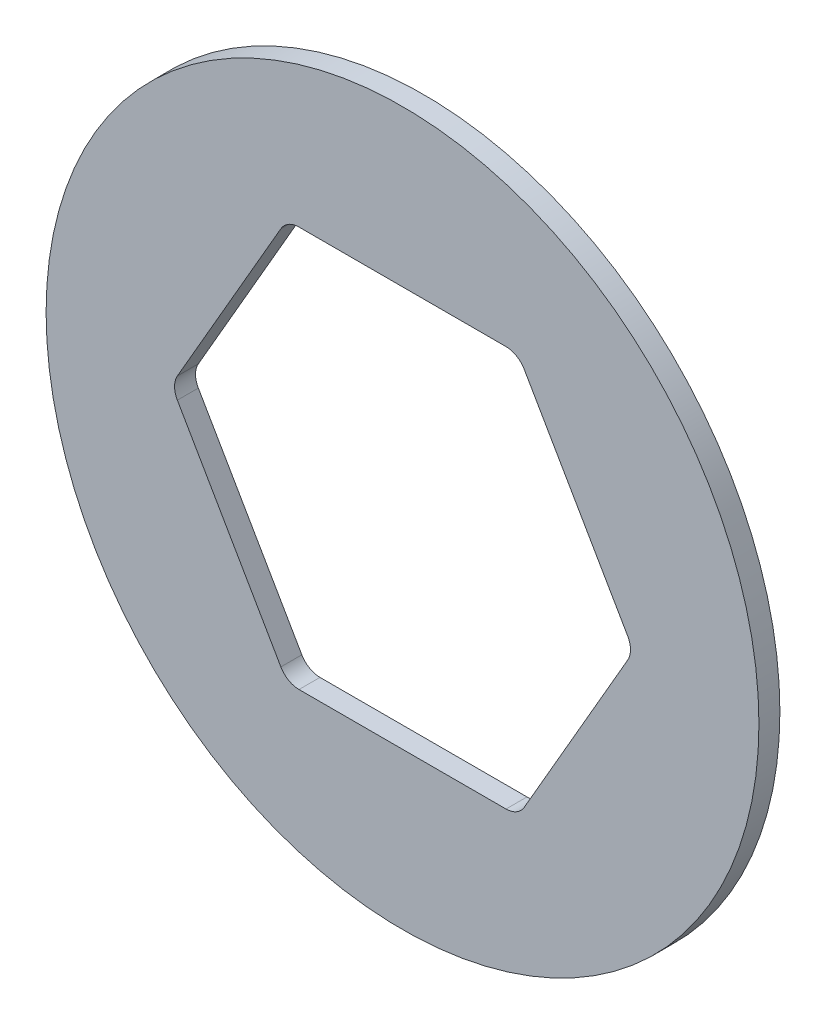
ISO-10303-21;
HEADER;
FILE_DESCRIPTION(('STEP AP214'),'2;1');
FILE_NAME('part.step','',(''),(''),'','','');
FILE_SCHEMA(('AUTOMOTIVE_DESIGN { 1 0 10303 214 1 1 1 1 }'));
ENDSEC;
DATA;
#1=APPLICATION_CONTEXT('core data for automotive mechanical design processes');
#2=APPLICATION_PROTOCOL_DEFINITION('international standard','automotive_design',2000,#1);
#3=PRODUCT_CONTEXT('',#1,'mechanical');
#4=PRODUCT('Part','Part','',(#3));
#5=PRODUCT_RELATED_PRODUCT_CATEGORY('part','',(#4));
#6=PRODUCT_DEFINITION_FORMATION('','',#4);
#7=PRODUCT_DEFINITION_CONTEXT('part definition',#1,'design');
#8=PRODUCT_DEFINITION('design','',#6,#7);
#9=PRODUCT_DEFINITION_SHAPE('','',#8);
#10=(LENGTH_UNIT() NAMED_UNIT(*) SI_UNIT(.MILLI.,.METRE.));
#11=(NAMED_UNIT(*) PLANE_ANGLE_UNIT() SI_UNIT($,.RADIAN.));
#12=(NAMED_UNIT(*) SI_UNIT($,.STERADIAN.) SOLID_ANGLE_UNIT());
#13=UNCERTAINTY_MEASURE_WITH_UNIT(LENGTH_MEASURE(1.E-05),#10,'distance_accuracy_value','');
#14=(GEOMETRIC_REPRESENTATION_CONTEXT(3) GLOBAL_UNCERTAINTY_ASSIGNED_CONTEXT((#13)) GLOBAL_UNIT_ASSIGNED_CONTEXT((#10,
#11,#12)) REPRESENTATION_CONTEXT('',''));
#15=CARTESIAN_POINT('',(0.,0.,0.));
#16=DIRECTION('',(0.,0.,1.));
#17=DIRECTION('',(1.,0.,0.));
#18=AXIS2_PLACEMENT_3D('',#15,#16,#17);
#19=CARTESIAN_POINT('',(0.,0.,1.));
#20=DIRECTION('',(0.,0.,1.));
#21=DIRECTION('',(1.,0.,0.));
#22=AXIS2_PLACEMENT_3D('',#19,#20,#21);
#23=PLANE('',#22);
#24=CARTESIAN_POINT('',(0.,0.,1.));
#25=DIRECTION('',(0.,0.,1.));
#26=DIRECTION('',(1.,0.,0.));
#27=AXIS2_PLACEMENT_3D('',#24,#25,#26);
#28=CIRCLE('',#27,17.);
#29=CARTESIAN_POINT('',(17.,0.,1.));
#30=VERTEX_POINT('',#29);
#31=EDGE_CURVE('E149',#30,#30,#28,.T.);
#32=ORIENTED_EDGE('',*,*,#31,.T.);
#33=EDGE_LOOP('',(#32));
#34=FACE_BOUND('',#33,.T.);
#35=DIRECTION('',(0.5,0.866025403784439,0.));
#36=VECTOR('',#35,1.);
#37=CARTESIAN_POINT('',(5.51369507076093,-9.55,1.));
#38=LINE('',#37,#36);
#39=CARTESIAN_POINT('',(5.80237020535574,-9.05,1.));
#40=VERTEX_POINT('',#39);
#41=CARTESIAN_POINT('',(10.738715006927,-0.499999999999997,1.));
#42=VERTEX_POINT('',#41);
#43=EDGE_CURVE('E213',#40,#42,#38,.T.);
#44=ORIENTED_EDGE('',*,*,#43,.F.);
#45=CARTESIAN_POINT('',(4.9363448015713,-8.55,1.));
#46=DIRECTION('',(0.,0.,1.));
#47=DIRECTION('',(1.,0.,0.));
#48=AXIS2_PLACEMENT_3D('',#45,#46,#47);
#49=CIRCLE('',#48,1.);
#50=CARTESIAN_POINT('',(4.9363448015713,-9.55,1.));
#51=VERTEX_POINT('',#50);
#52=EDGE_CURVE('E134',#40,#51,#49,.F.);
#53=ORIENTED_EDGE('',*,*,#52,.T.);
#54=DIRECTION('',(1.,0.,0.));
#55=VECTOR('',#54,1.);
#56=CARTESIAN_POINT('',(-5.51369507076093,-9.55,1.));
#57=LINE('',#56,#55);
#58=CARTESIAN_POINT('',(-4.9363448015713,-9.55,1.));
#59=VERTEX_POINT('',#58);
#60=EDGE_CURVE('E217',#59,#51,#57,.T.);
#61=ORIENTED_EDGE('',*,*,#60,.F.);
#62=CARTESIAN_POINT('',(-4.9363448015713,-8.55,1.));
#63=DIRECTION('',(0.,0.,1.));
#64=DIRECTION('',(1.,0.,0.));
#65=AXIS2_PLACEMENT_3D('',#62,#63,#64);
#66=CIRCLE('',#65,1.);
#67=CARTESIAN_POINT('',(-5.80237020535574,-9.05,1.));
#68=VERTEX_POINT('',#67);
#69=EDGE_CURVE('E186',#59,#68,#66,.F.);
#70=ORIENTED_EDGE('',*,*,#69,.T.);
#71=DIRECTION('',(0.5,-0.866025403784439,0.));
#72=VECTOR('',#71,1.);
#73=CARTESIAN_POINT('',(-11.0273901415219,0.,1.));
#74=LINE('',#73,#72);
#75=CARTESIAN_POINT('',(-10.738715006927,-0.499999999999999,1.));
#76=VERTEX_POINT('',#75);
#77=EDGE_CURVE('E223',#76,#68,#74,.T.);
#78=ORIENTED_EDGE('',*,*,#77,.F.);
#79=CARTESIAN_POINT('',(-9.8726896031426,0.,1.));
#80=DIRECTION('',(0.,0.,1.));
#81=DIRECTION('',(1.,0.,0.));
#82=AXIS2_PLACEMENT_3D('',#79,#80,#81);
#83=CIRCLE('',#82,1.);
#84=CARTESIAN_POINT('',(-10.738715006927,0.500000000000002,1.));
#85=VERTEX_POINT('',#84);
#86=EDGE_CURVE('E190',#76,#85,#83,.F.);
#87=ORIENTED_EDGE('',*,*,#86,.T.);
#88=DIRECTION('',(-0.5,-0.866025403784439,0.));
#89=VECTOR('',#88,1.);
#90=CARTESIAN_POINT('',(-5.51369507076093,9.55,1.));
#91=LINE('',#90,#89);
#92=CARTESIAN_POINT('',(-5.80237020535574,9.05,1.));
#93=VERTEX_POINT('',#92);
#94=EDGE_CURVE('E215',#93,#85,#91,.T.);
#95=ORIENTED_EDGE('',*,*,#94,.F.);
#96=CARTESIAN_POINT('',(-4.9363448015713,8.55,1.));
#97=DIRECTION('',(0.,0.,1.));
#98=DIRECTION('',(1.,0.,0.));
#99=AXIS2_PLACEMENT_3D('',#96,#97,#98);
#100=CIRCLE('',#99,1.);
#101=CARTESIAN_POINT('',(-4.9363448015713,9.55,1.));
#102=VERTEX_POINT('',#101);
#103=EDGE_CURVE('E48',#93,#102,#100,.F.);
#104=ORIENTED_EDGE('',*,*,#103,.T.);
#105=DIRECTION('',(-1.,0.,0.));
#106=VECTOR('',#105,1.);
#107=CARTESIAN_POINT('',(5.51369507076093,9.55,1.));
#108=LINE('',#107,#106);
#109=CARTESIAN_POINT('',(4.9363448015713,9.55,1.));
#110=VERTEX_POINT('',#109);
#111=EDGE_CURVE('E209',#110,#102,#108,.T.);
#112=ORIENTED_EDGE('',*,*,#111,.F.);
#113=CARTESIAN_POINT('',(4.9363448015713,8.55,1.));
#114=DIRECTION('',(0.,0.,1.));
#115=DIRECTION('',(1.,0.,0.));
#116=AXIS2_PLACEMENT_3D('',#113,#114,#115);
#117=CIRCLE('',#116,1.);
#118=CARTESIAN_POINT('',(5.80237020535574,9.05,1.));
#119=VERTEX_POINT('',#118);
#120=EDGE_CURVE('E11',#110,#119,#117,.F.);
#121=ORIENTED_EDGE('',*,*,#120,.T.);
#122=DIRECTION('',(-0.5,0.866025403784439,0.));
#123=VECTOR('',#122,1.);
#124=CARTESIAN_POINT('',(11.0273901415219,0.,1.));
#125=LINE('',#124,#123);
#126=CARTESIAN_POINT('',(10.738715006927,0.5,1.));
#127=VERTEX_POINT('',#126);
#128=EDGE_CURVE('E207',#127,#119,#125,.T.);
#129=ORIENTED_EDGE('',*,*,#128,.F.);
#130=CARTESIAN_POINT('',(9.8726896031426,0.,1.));
#131=DIRECTION('',(0.,0.,1.));
#132=DIRECTION('',(1.,0.,0.));
#133=AXIS2_PLACEMENT_3D('',#130,#131,#132);
#134=CIRCLE('',#133,1.);
#135=EDGE_CURVE('E135',#127,#42,#134,.F.);
#136=ORIENTED_EDGE('',*,*,#135,.T.);
#137=EDGE_LOOP('',(#44,#53,#61,#70,#78,#87,#95,#104,#112,#121,#129,#136));
#138=FACE_BOUND('',#137,.T.);
#139=ADVANCED_FACE('F33',(#34,#138),#23,.T.);
#140=CARTESIAN_POINT('',(0.,0.,0.));
#141=DIRECTION('',(0.,0.,1.));
#142=DIRECTION('',(1.,0.,0.));
#143=AXIS2_PLACEMENT_3D('',#140,#141,#142);
#144=PLANE('',#143);
#145=CARTESIAN_POINT('',(0.,0.,0.));
#146=DIRECTION('',(0.,0.,1.));
#147=DIRECTION('',(1.,0.,0.));
#148=AXIS2_PLACEMENT_3D('',#145,#146,#147);
#149=CIRCLE('',#148,17.);
#150=CARTESIAN_POINT('',(17.,0.,0.));
#151=VERTEX_POINT('',#150);
#152=EDGE_CURVE('E154',#151,#151,#149,.T.);
#153=ORIENTED_EDGE('',*,*,#152,.F.);
#154=EDGE_LOOP('',(#153));
#155=FACE_BOUND('',#154,.T.);
#156=DIRECTION('',(0.5,-0.866025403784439,0.));
#157=VECTOR('',#156,1.);
#158=CARTESIAN_POINT('',(-11.0273901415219,0.,0.));
#159=LINE('',#158,#157);
#160=CARTESIAN_POINT('',(-10.738715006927,-0.499999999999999,0.));
#161=VERTEX_POINT('',#160);
#162=CARTESIAN_POINT('',(-5.80237020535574,-9.05,0.));
#163=VERTEX_POINT('',#162);
#164=EDGE_CURVE('E230',#161,#163,#159,.T.);
#165=ORIENTED_EDGE('',*,*,#164,.T.);
#166=CARTESIAN_POINT('',(-4.9363448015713,-8.55,0.));
#167=DIRECTION('',(0.,0.,1.));
#168=DIRECTION('',(1.,0.,0.));
#169=AXIS2_PLACEMENT_3D('',#166,#167,#168);
#170=CIRCLE('',#169,1.);
#171=CARTESIAN_POINT('',(-4.9363448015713,-9.55,0.));
#172=VERTEX_POINT('',#171);
#173=EDGE_CURVE('E184',#163,#172,#170,.T.);
#174=ORIENTED_EDGE('',*,*,#173,.T.);
#175=DIRECTION('',(1.,0.,0.));
#176=VECTOR('',#175,1.);
#177=CARTESIAN_POINT('',(-5.51369507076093,-9.55,0.));
#178=LINE('',#177,#176);
#179=CARTESIAN_POINT('',(4.9363448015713,-9.55,0.));
#180=VERTEX_POINT('',#179);
#181=EDGE_CURVE('E129',#172,#180,#178,.T.);
#182=ORIENTED_EDGE('',*,*,#181,.T.);
#183=CARTESIAN_POINT('',(4.9363448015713,-8.55,0.));
#184=DIRECTION('',(0.,0.,1.));
#185=DIRECTION('',(1.,0.,0.));
#186=AXIS2_PLACEMENT_3D('',#183,#184,#185);
#187=CIRCLE('',#186,1.);
#188=CARTESIAN_POINT('',(5.80237020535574,-9.05,0.));
#189=VERTEX_POINT('',#188);
#190=EDGE_CURVE('E123',#180,#189,#187,.T.);
#191=ORIENTED_EDGE('',*,*,#190,.T.);
#192=DIRECTION('',(0.5,0.866025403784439,0.));
#193=VECTOR('',#192,1.);
#194=CARTESIAN_POINT('',(5.51369507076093,-9.55,0.));
#195=LINE('',#194,#193);
#196=CARTESIAN_POINT('',(10.738715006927,-0.499999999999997,0.));
#197=VERTEX_POINT('',#196);
#198=EDGE_CURVE('E127',#189,#197,#195,.T.);
#199=ORIENTED_EDGE('',*,*,#198,.T.);
#200=CARTESIAN_POINT('',(9.8726896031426,0.,0.));
#201=DIRECTION('',(0.,0.,1.));
#202=DIRECTION('',(1.,0.,0.));
#203=AXIS2_PLACEMENT_3D('',#200,#201,#202);
#204=CIRCLE('',#203,1.);
#205=CARTESIAN_POINT('',(10.738715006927,0.5,0.));
#206=VERTEX_POINT('',#205);
#207=EDGE_CURVE('E180',#197,#206,#204,.T.);
#208=ORIENTED_EDGE('',*,*,#207,.T.);
#209=DIRECTION('',(-0.5,0.866025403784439,0.));
#210=VECTOR('',#209,1.);
#211=CARTESIAN_POINT('',(11.0273901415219,0.,0.));
#212=LINE('',#211,#210);
#213=CARTESIAN_POINT('',(5.80237020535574,9.05,0.));
#214=VERTEX_POINT('',#213);
#215=EDGE_CURVE('E145',#206,#214,#212,.T.);
#216=ORIENTED_EDGE('',*,*,#215,.T.);
#217=CARTESIAN_POINT('',(4.9363448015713,8.55,0.));
#218=DIRECTION('',(0.,0.,1.));
#219=DIRECTION('',(1.,0.,0.));
#220=AXIS2_PLACEMENT_3D('',#217,#218,#219);
#221=CIRCLE('',#220,1.);
#222=CARTESIAN_POINT('',(4.9363448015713,9.55,0.));
#223=VERTEX_POINT('',#222);
#224=EDGE_CURVE('E41',#214,#223,#221,.T.);
#225=ORIENTED_EDGE('',*,*,#224,.T.);
#226=DIRECTION('',(-1.,0.,0.));
#227=VECTOR('',#226,1.);
#228=CARTESIAN_POINT('',(5.51369507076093,9.55,0.));
#229=LINE('',#228,#227);
#230=CARTESIAN_POINT('',(-4.9363448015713,9.55,0.));
#231=VERTEX_POINT('',#230);
#232=EDGE_CURVE('E196',#223,#231,#229,.T.);
#233=ORIENTED_EDGE('',*,*,#232,.T.);
#234=CARTESIAN_POINT('',(-4.9363448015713,8.55,0.));
#235=DIRECTION('',(0.,0.,1.));
#236=DIRECTION('',(1.,0.,0.));
#237=AXIS2_PLACEMENT_3D('',#234,#235,#236);
#238=CIRCLE('',#237,1.);
#239=CARTESIAN_POINT('',(-5.80237020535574,9.05,0.));
#240=VERTEX_POINT('',#239);
#241=EDGE_CURVE('E192',#231,#240,#238,.T.);
#242=ORIENTED_EDGE('',*,*,#241,.T.);
#243=DIRECTION('',(-0.5,-0.866025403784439,0.));
#244=VECTOR('',#243,1.);
#245=CARTESIAN_POINT('',(-5.51369507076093,9.55,0.));
#246=LINE('',#245,#244);
#247=CARTESIAN_POINT('',(-10.738715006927,0.500000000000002,0.));
#248=VERTEX_POINT('',#247);
#249=EDGE_CURVE('E202',#240,#248,#246,.T.);
#250=ORIENTED_EDGE('',*,*,#249,.T.);
#251=CARTESIAN_POINT('',(-9.8726896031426,0.,0.));
#252=DIRECTION('',(0.,0.,1.));
#253=DIRECTION('',(1.,0.,0.));
#254=AXIS2_PLACEMENT_3D('',#251,#252,#253);
#255=CIRCLE('',#254,1.);
#256=EDGE_CURVE('E188',#248,#161,#255,.T.);
#257=ORIENTED_EDGE('',*,*,#256,.T.);
#258=EDGE_LOOP('',(#165,#174,#182,#191,#199,#208,#216,#225,#233,#242,#250,#257));
#259=FACE_BOUND('',#258,.T.);
#260=ADVANCED_FACE('F126',(#155,#259),#144,.F.);
#261=CARTESIAN_POINT('',(0.,0.,1.));
#262=DIRECTION('',(0.,0.,-1.));
#263=DIRECTION('',(-1.,0.,0.));
#264=AXIS2_PLACEMENT_3D('',#261,#262,#263);
#265=CYLINDRICAL_SURFACE('',#264,17.);
#266=ORIENTED_EDGE('',*,*,#31,.F.);
#267=EDGE_LOOP('',(#266));
#268=FACE_BOUND('',#267,.T.);
#269=ORIENTED_EDGE('',*,*,#152,.T.);
#270=EDGE_LOOP('',(#269));
#271=FACE_BOUND('',#270,.T.);
#272=ADVANCED_FACE('F267',(#268,#271),#265,.T.);
#273=CARTESIAN_POINT('',(-5.51369507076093,-9.55,1.));
#274=DIRECTION('',(0.,1.,0.));
#275=DIRECTION('',(-1.,0.,0.));
#276=AXIS2_PLACEMENT_3D('',#273,#274,#275);
#277=PLANE('',#276);
#278=ORIENTED_EDGE('',*,*,#60,.T.);
#279=DIRECTION('',(0.,0.,-1.));
#280=VECTOR('',#279,1.);
#281=CARTESIAN_POINT('',(4.9363448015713,-9.55,0.));
#282=LINE('',#281,#280);
#283=EDGE_CURVE('E164',#51,#180,#282,.T.);
#284=ORIENTED_EDGE('',*,*,#283,.T.);
#285=ORIENTED_EDGE('',*,*,#181,.F.);
#286=DIRECTION('',(0.,0.,-1.));
#287=VECTOR('',#286,1.);
#288=CARTESIAN_POINT('',(-4.9363448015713,-9.55,1.));
#289=LINE('',#288,#287);
#290=EDGE_CURVE('E162',#172,#59,#289,.F.);
#291=ORIENTED_EDGE('',*,*,#290,.T.);
#292=EDGE_LOOP('',(#278,#284,#285,#291));
#293=FACE_BOUND('',#292,.T.);
#294=ADVANCED_FACE('F235',(#293),#277,.T.);
#295=CARTESIAN_POINT('',(5.51369507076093,-9.55,1.));
#296=DIRECTION('',(-0.866025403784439,0.5,0.));
#297=DIRECTION('',(-0.5,-0.866025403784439,0.));
#298=AXIS2_PLACEMENT_3D('',#295,#296,#297);
#299=PLANE('',#298);
#300=ORIENTED_EDGE('',*,*,#43,.T.);
#301=DIRECTION('',(0.,0.,-1.));
#302=VECTOR('',#301,1.);
#303=CARTESIAN_POINT('',(10.738715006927,-0.5,0.));
#304=LINE('',#303,#302);
#305=EDGE_CURVE('E144',#42,#197,#304,.T.);
#306=ORIENTED_EDGE('',*,*,#305,.T.);
#307=ORIENTED_EDGE('',*,*,#198,.F.);
#308=DIRECTION('',(0.,0.,-1.));
#309=VECTOR('',#308,1.);
#310=CARTESIAN_POINT('',(5.80237020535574,-9.05,1.));
#311=LINE('',#310,#309);
#312=EDGE_CURVE('E141',#189,#40,#311,.F.);
#313=ORIENTED_EDGE('',*,*,#312,.T.);
#314=EDGE_LOOP('',(#300,#306,#307,#313));
#315=FACE_BOUND('',#314,.T.);
#316=ADVANCED_FACE('F140',(#315),#299,.T.);
#317=CARTESIAN_POINT('',(11.0273901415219,0.,1.));
#318=DIRECTION('',(-0.866025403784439,-0.5,0.));
#319=DIRECTION('',(0.5,-0.866025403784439,0.));
#320=AXIS2_PLACEMENT_3D('',#317,#318,#319);
#321=PLANE('',#320);
#322=ORIENTED_EDGE('',*,*,#215,.F.);
#323=DIRECTION('',(0.,0.,-1.));
#324=VECTOR('',#323,1.);
#325=CARTESIAN_POINT('',(10.738715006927,0.5,1.));
#326=LINE('',#325,#324);
#327=EDGE_CURVE('E160',#206,#127,#326,.F.);
#328=ORIENTED_EDGE('',*,*,#327,.T.);
#329=ORIENTED_EDGE('',*,*,#128,.T.);
#330=DIRECTION('',(0.,0.,-1.));
#331=VECTOR('',#330,1.);
#332=CARTESIAN_POINT('',(5.80237020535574,9.05,0.));
#333=LINE('',#332,#331);
#334=EDGE_CURVE('E151',#119,#214,#333,.T.);
#335=ORIENTED_EDGE('',*,*,#334,.T.);
#336=EDGE_LOOP('',(#322,#328,#329,#335));
#337=FACE_BOUND('',#336,.T.);
#338=ADVANCED_FACE('F211',(#337),#321,.T.);
#339=CARTESIAN_POINT('',(5.51369507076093,9.55,1.));
#340=DIRECTION('',(0.,-1.,0.));
#341=DIRECTION('',(0.,0.,-1.));
#342=AXIS2_PLACEMENT_3D('',#339,#340,#341);
#343=PLANE('',#342);
#344=ORIENTED_EDGE('',*,*,#111,.T.);
#345=DIRECTION('',(0.,0.,-1.));
#346=VECTOR('',#345,1.);
#347=CARTESIAN_POINT('',(-4.9363448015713,9.55,0.));
#348=LINE('',#347,#346);
#349=EDGE_CURVE('E177',#102,#231,#348,.T.);
#350=ORIENTED_EDGE('',*,*,#349,.T.);
#351=ORIENTED_EDGE('',*,*,#232,.F.);
#352=DIRECTION('',(0.,0.,-1.));
#353=VECTOR('',#352,1.);
#354=CARTESIAN_POINT('',(4.9363448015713,9.55,1.));
#355=LINE('',#354,#353);
#356=EDGE_CURVE('E55',#223,#110,#355,.F.);
#357=ORIENTED_EDGE('',*,*,#356,.T.);
#358=EDGE_LOOP('',(#344,#350,#351,#357));
#359=FACE_BOUND('',#358,.T.);
#360=ADVANCED_FACE('F200',(#359),#343,.T.);
#361=CARTESIAN_POINT('',(-5.51369507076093,9.55,1.));
#362=DIRECTION('',(0.866025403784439,-0.5,0.));
#363=DIRECTION('',(0.5,0.866025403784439,0.));
#364=AXIS2_PLACEMENT_3D('',#361,#362,#363);
#365=PLANE('',#364);
#366=ORIENTED_EDGE('',*,*,#94,.T.);
#367=DIRECTION('',(0.,0.,-1.));
#368=VECTOR('',#367,1.);
#369=CARTESIAN_POINT('',(-10.738715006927,0.500000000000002,0.));
#370=LINE('',#369,#368);
#371=EDGE_CURVE('E173',#85,#248,#370,.T.);
#372=ORIENTED_EDGE('',*,*,#371,.T.);
#373=ORIENTED_EDGE('',*,*,#249,.F.);
#374=DIRECTION('',(0.,0.,-1.));
#375=VECTOR('',#374,1.);
#376=CARTESIAN_POINT('',(-5.80237020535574,9.05,1.));
#377=LINE('',#376,#375);
#378=EDGE_CURVE('E171',#240,#93,#377,.F.);
#379=ORIENTED_EDGE('',*,*,#378,.T.);
#380=EDGE_LOOP('',(#366,#372,#373,#379));
#381=FACE_BOUND('',#380,.T.);
#382=ADVANCED_FACE('F251',(#381),#365,.T.);
#383=CARTESIAN_POINT('',(-11.0273901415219,0.,1.));
#384=DIRECTION('',(0.866025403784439,0.5,0.));
#385=DIRECTION('',(-0.5,0.866025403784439,0.));
#386=AXIS2_PLACEMENT_3D('',#383,#384,#385);
#387=PLANE('',#386);
#388=ORIENTED_EDGE('',*,*,#77,.T.);
#389=DIRECTION('',(0.,0.,-1.));
#390=VECTOR('',#389,1.);
#391=CARTESIAN_POINT('',(-5.80237020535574,-9.05,0.));
#392=LINE('',#391,#390);
#393=EDGE_CURVE('E168',#68,#163,#392,.T.);
#394=ORIENTED_EDGE('',*,*,#393,.T.);
#395=ORIENTED_EDGE('',*,*,#164,.F.);
#396=DIRECTION('',(0.,0.,-1.));
#397=VECTOR('',#396,1.);
#398=CARTESIAN_POINT('',(-10.738715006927,-0.499999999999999,1.));
#399=LINE('',#398,#397);
#400=EDGE_CURVE('E166',#161,#76,#399,.F.);
#401=ORIENTED_EDGE('',*,*,#400,.T.);
#402=EDGE_LOOP('',(#388,#394,#395,#401));
#403=FACE_BOUND('',#402,.T.);
#404=ADVANCED_FACE('F243',(#403),#387,.T.);
#405=CARTESIAN_POINT('',(9.8726896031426,0.,1.));
#406=DIRECTION('',(0.,0.,1.));
#407=DIRECTION('',(1.,0.,0.));
#408=AXIS2_PLACEMENT_3D('',#405,#406,#407);
#409=CYLINDRICAL_SURFACE('',#408,1.);
#410=ORIENTED_EDGE('',*,*,#135,.F.);
#411=ORIENTED_EDGE('',*,*,#327,.F.);
#412=ORIENTED_EDGE('',*,*,#207,.F.);
#413=ORIENTED_EDGE('',*,*,#305,.F.);
#414=EDGE_LOOP('',(#410,#411,#412,#413));
#415=FACE_BOUND('',#414,.T.);
#416=ADVANCED_FACE('F276',(#415),#409,.F.);
#417=CARTESIAN_POINT('',(4.9363448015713,-8.55,1.));
#418=DIRECTION('',(0.,0.,1.));
#419=DIRECTION('',(1.,0.,0.));
#420=AXIS2_PLACEMENT_3D('',#417,#418,#419);
#421=CYLINDRICAL_SURFACE('',#420,1.);
#422=ORIENTED_EDGE('',*,*,#52,.F.);
#423=ORIENTED_EDGE('',*,*,#312,.F.);
#424=ORIENTED_EDGE('',*,*,#190,.F.);
#425=ORIENTED_EDGE('',*,*,#283,.F.);
#426=EDGE_LOOP('',(#422,#423,#424,#425));
#427=FACE_BOUND('',#426,.T.);
#428=ADVANCED_FACE('F148',(#427),#421,.F.);
#429=CARTESIAN_POINT('',(-4.9363448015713,-8.55,1.));
#430=DIRECTION('',(0.,0.,1.));
#431=DIRECTION('',(1.,0.,0.));
#432=AXIS2_PLACEMENT_3D('',#429,#430,#431);
#433=CYLINDRICAL_SURFACE('',#432,1.);
#434=ORIENTED_EDGE('',*,*,#69,.F.);
#435=ORIENTED_EDGE('',*,*,#290,.F.);
#436=ORIENTED_EDGE('',*,*,#173,.F.);
#437=ORIENTED_EDGE('',*,*,#393,.F.);
#438=EDGE_LOOP('',(#434,#435,#436,#437));
#439=FACE_BOUND('',#438,.T.);
#440=ADVANCED_FACE('F241',(#439),#433,.F.);
#441=CARTESIAN_POINT('',(-9.8726896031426,0.,1.));
#442=DIRECTION('',(0.,0.,1.));
#443=DIRECTION('',(1.,0.,0.));
#444=AXIS2_PLACEMENT_3D('',#441,#442,#443);
#445=CYLINDRICAL_SURFACE('',#444,1.);
#446=ORIENTED_EDGE('',*,*,#86,.F.);
#447=ORIENTED_EDGE('',*,*,#400,.F.);
#448=ORIENTED_EDGE('',*,*,#256,.F.);
#449=ORIENTED_EDGE('',*,*,#371,.F.);
#450=EDGE_LOOP('',(#446,#447,#448,#449));
#451=FACE_BOUND('',#450,.T.);
#452=ADVANCED_FACE('F248',(#451),#445,.F.);
#453=CARTESIAN_POINT('',(-4.9363448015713,8.55,1.));
#454=DIRECTION('',(0.,0.,1.));
#455=DIRECTION('',(1.,0.,0.));
#456=AXIS2_PLACEMENT_3D('',#453,#454,#455);
#457=CYLINDRICAL_SURFACE('',#456,1.);
#458=ORIENTED_EDGE('',*,*,#103,.F.);
#459=ORIENTED_EDGE('',*,*,#378,.F.);
#460=ORIENTED_EDGE('',*,*,#241,.F.);
#461=ORIENTED_EDGE('',*,*,#349,.F.);
#462=EDGE_LOOP('',(#458,#459,#460,#461));
#463=FACE_BOUND('',#462,.T.);
#464=ADVANCED_FACE('F254',(#463),#457,.F.);
#465=CARTESIAN_POINT('',(4.9363448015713,8.55,1.));
#466=DIRECTION('',(0.,0.,1.));
#467=DIRECTION('',(1.,0.,0.));
#468=AXIS2_PLACEMENT_3D('',#465,#466,#467);
#469=CYLINDRICAL_SURFACE('',#468,1.);
#470=ORIENTED_EDGE('',*,*,#120,.F.);
#471=ORIENTED_EDGE('',*,*,#356,.F.);
#472=ORIENTED_EDGE('',*,*,#224,.F.);
#473=ORIENTED_EDGE('',*,*,#334,.F.);
#474=EDGE_LOOP('',(#470,#471,#472,#473));
#475=FACE_BOUND('',#474,.T.);
#476=ADVANCED_FACE('F35',(#475),#469,.F.);
#477=CLOSED_SHELL('',(#139,#260,#272,#294,#316,#338,#360,#382,#404,#416,#428,#440,#452,#464,#476));
#478=MANIFOLD_SOLID_BREP('B2',#477);
#479=ADVANCED_BREP_SHAPE_REPRESENTATION('',(#18,#478),#14);
#480=SHAPE_DEFINITION_REPRESENTATION(#9,#479);
ENDSEC;
END-ISO-10303-21;
